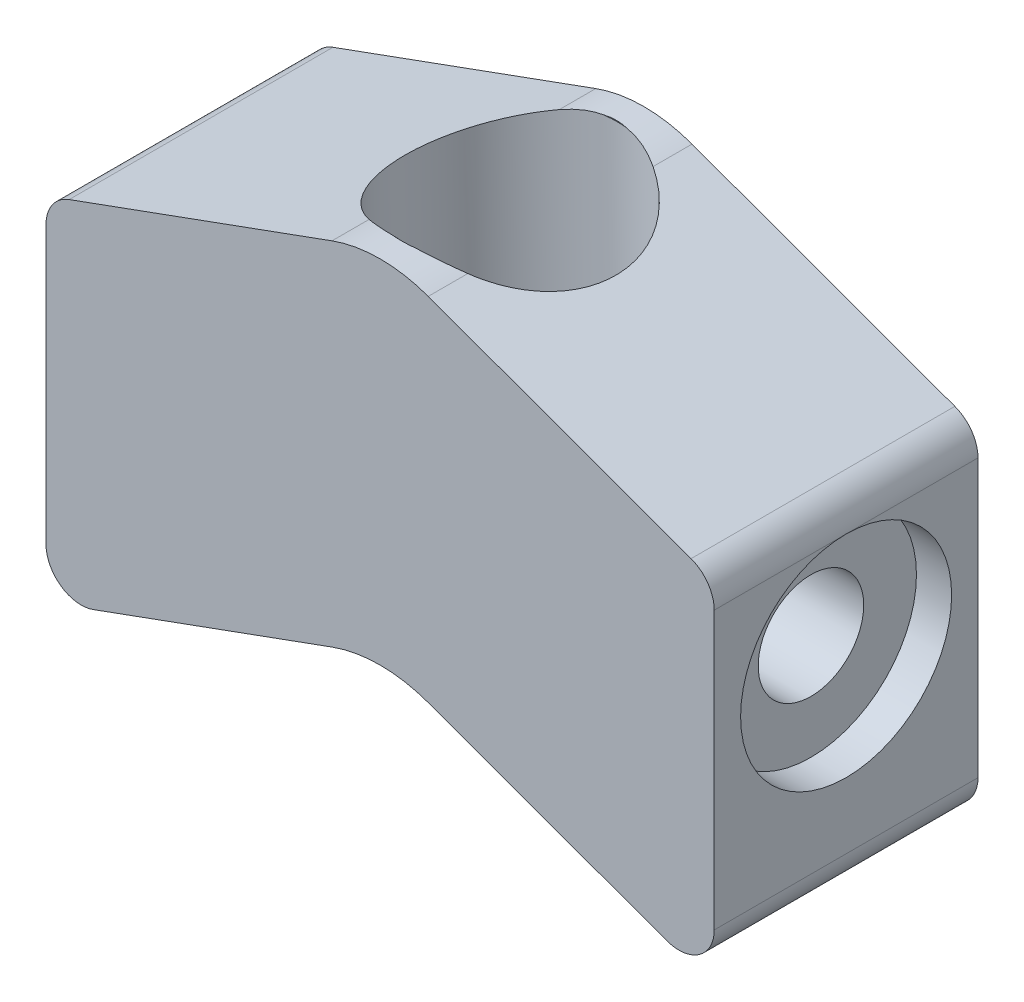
from build123d import *

# Parameters (mm, degrees)
EXTRUDE_1_DEPTH        = 15
SKETCH_2_R             = 6
SKETCH_2_R_2           = 3
CUT_EXTRUDE_1_DEPTH    = 2
SKETCH_2_2_R           = 3
CUT_EXTRUDE_2_DEPTH    = 50.531468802
F_12_0MM_1_D           = 12
F_12_0MM_1_CSINK_D     = 12.05
F_12_0MM_1_CSINK_ANGLE = 90


with BuildPart() as part:
    # Sketch 1 → Extrude 1 (new body)
    with BuildSketch(Plane.XY):
        with BuildLine():
            Line((16.315959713, 2.574898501), (2.736161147, 7.517540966))
            ThreePointArc((2.736161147, 7.517540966), (0, 8), (-2.736161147, 7.517540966))
            Line((-2.736161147, 7.517540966), (-16.315959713, 2.574898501))
            ThreePointArc((-16.315959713, 2.574898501), (-18.147152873, 2.815979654), (-19, 4.454283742))
            Line((-19, 4.454283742), (-19, 20.204114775))
            ThreePointArc((-19, 20.204114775), (-18.638304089, 21.351267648), (-17.684040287, 22.083500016))
            Line((-17.684040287, 22.083500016), (-2.736161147, 27.524083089))
            ThreePointArc((-2.736161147, 27.524083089), (0, 28.006542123), (2.736161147, 27.524083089))
            Line((2.736161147, 27.524083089), (17.684040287, 22.083500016))
            ThreePointArc((17.684040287, 22.083500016), (18.638304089, 21.351267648), (19, 20.204114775))
            Line((19, 20.204114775), (19, 4.454283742))
            ThreePointArc((19, 4.454283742), (18.147152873, 2.815979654), (16.315959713, 2.574898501))
        make_face()
    extrude(amount=EXTRUDE_1_DEPTH)

    # Sketch 2 → Cut-Extrude 1 (cut)
    with BuildSketch(Plane(origin=(19, 0, 0), x_dir=(0, 0, -1), z_dir=(1, 0, 0))):
        with Locations((-7.5, 14.204114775)):
            Circle(SKETCH_2_R)
        with Locations((-7.5, 14.204114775)):
            Circle(SKETCH_2_R_2, mode=Mode.SUBTRACT)
    cut_extrude_1 = extrude(amount=-CUT_EXTRUDE_1_DEPTH, mode=Mode.SUBTRACT)

    # Sketch 2_2 → Cut-Extrude 2 (cut, through all)
    with BuildSketch(Plane(origin=(19, 0, 0), x_dir=(0, 0, -1), z_dir=(1, 0, 0))):
        with Locations((-7.5, 14.204114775)):
            Circle(SKETCH_2_2_R)
    extrude(amount=-CUT_EXTRUDE_2_DEPTH, mode=Mode.SUBTRACT)

    # Mirror 1: Cut-Extrude 1 across plane
    add(cut_extrude_1.mirror(Plane(origin=(0, 0, 0), x_dir=(0, 0, 1), z_dir=(1, 0, 0))), mode=Mode.SUBTRACT)

    # 12.0mm _1 (through all)
    with Locations(Plane(origin=(-0.144990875, 28.005228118, 7.481016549), x_dir=(0.999835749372, 0.018123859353, 0), z_dir=(-0.018123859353, 0.999835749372, 0))):
        with Locations((0, 0)):
            CounterSinkHole(F_12_0MM_1_D / 2, F_12_0MM_1_CSINK_D / 2, counter_sink_angle=F_12_0MM_1_CSINK_ANGLE)


solid = part.part
